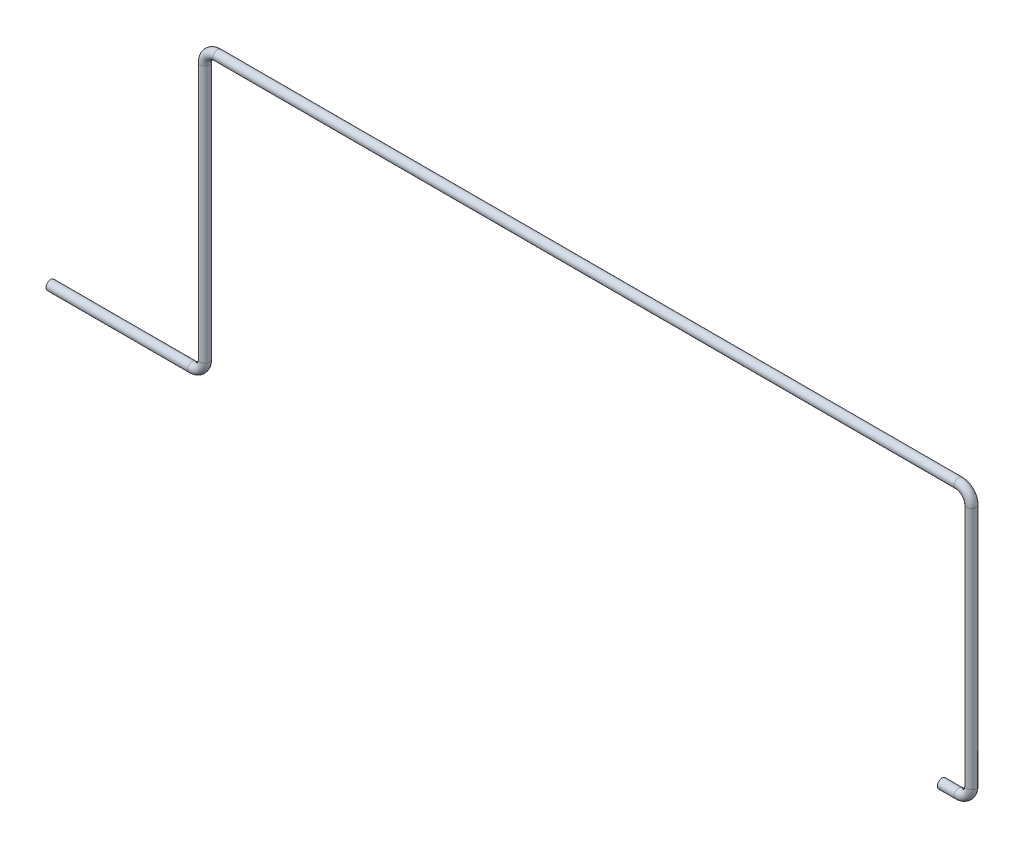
from build123d import *

# Parameters (mm, degrees)
CROQUIS3_R   = 22.25
CROQUIS3_R_2 = 19.05


with BuildPart() as part:
    # Barrer1: sweep along a path in Croquis1
    with BuildLine(Plane.XY) as barrer1_path:
        Line((0, 0), (675, 0))
        ThreePointArc((675, 0), (717.426406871, 17.573593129), (735, 60))
        Line((735, 60), (735, 1286.4))
        ThreePointArc((735, 1286.4), (752.573593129, 1328.826406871), (795, 1346.4))
        Line((795, 1346.4), (4325, 1346.4))
        ThreePointArc((4325, 1346.4), (4367.426406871, 1328.826406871), (4385, 1286.4))
        Line((4385, 1286.4), (4385, 126.4))
        ThreePointArc((4385, 126.4), (4367.426406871, 83.973593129), (4325, 66.4))
        Line((4325, 66.4), (4245, 66.4))
    # Croquis3 → Barrer1 (sweep)
    with BuildSketch(Plane(origin=(0, 0, 0), x_dir=(0, 0, -1), z_dir=(1, 0, 0))):
        Circle(CROQUIS3_R)
        Circle(CROQUIS3_R_2, mode=Mode.SUBTRACT)
    sweep(path=barrer1_path.line)


solid = part.part
